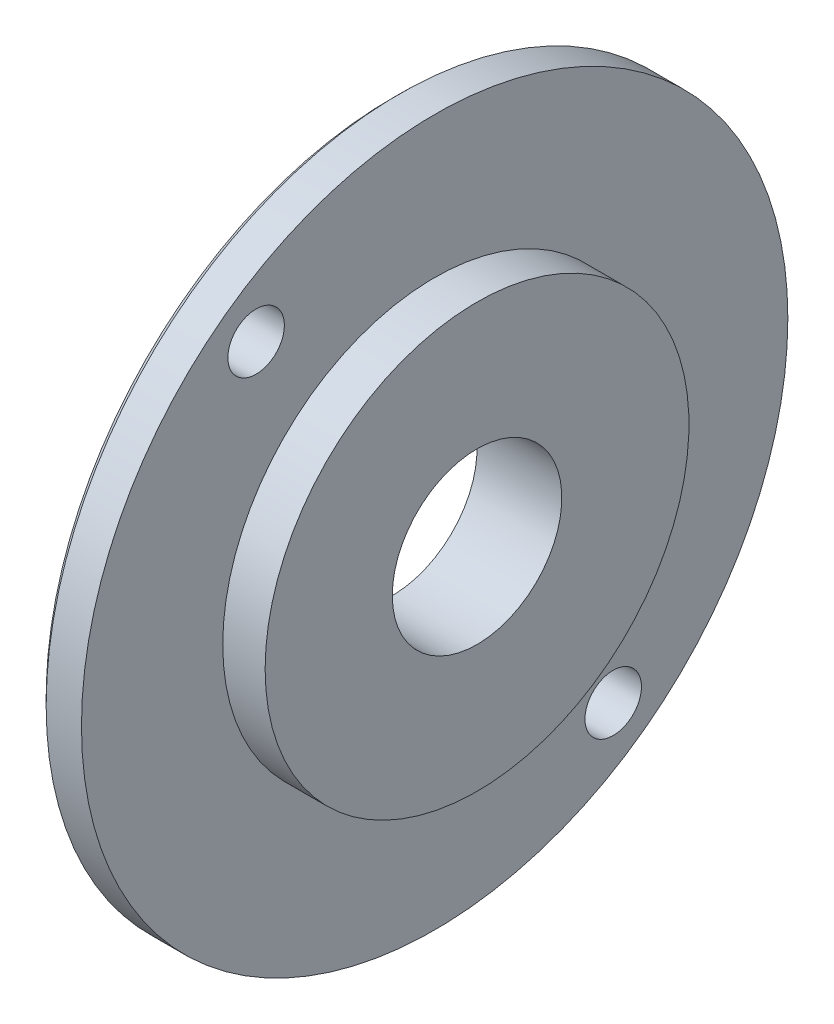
ISO-10303-21;
HEADER;
FILE_DESCRIPTION(('STEP AP214'),'2;1');
FILE_NAME('part.step','',(''),(''),'','','');
FILE_SCHEMA(('AUTOMOTIVE_DESIGN { 1 0 10303 214 1 1 1 1 }'));
ENDSEC;
DATA;
#1=APPLICATION_CONTEXT('core data for automotive mechanical design processes');
#2=APPLICATION_PROTOCOL_DEFINITION('international standard','automotive_design',2000,#1);
#3=PRODUCT_CONTEXT('',#1,'mechanical');
#4=PRODUCT('Part','Part','',(#3));
#5=PRODUCT_RELATED_PRODUCT_CATEGORY('part','',(#4));
#6=PRODUCT_DEFINITION_FORMATION('','',#4);
#7=PRODUCT_DEFINITION_CONTEXT('part definition',#1,'design');
#8=PRODUCT_DEFINITION('design','',#6,#7);
#9=PRODUCT_DEFINITION_SHAPE('','',#8);
#10=(LENGTH_UNIT() NAMED_UNIT(*) SI_UNIT(.MILLI.,.METRE.));
#11=(NAMED_UNIT(*) PLANE_ANGLE_UNIT() SI_UNIT($,.RADIAN.));
#12=(NAMED_UNIT(*) SI_UNIT($,.STERADIAN.) SOLID_ANGLE_UNIT());
#13=UNCERTAINTY_MEASURE_WITH_UNIT(LENGTH_MEASURE(1.E-05),#10,'distance_accuracy_value','');
#14=(GEOMETRIC_REPRESENTATION_CONTEXT(3) GLOBAL_UNCERTAINTY_ASSIGNED_CONTEXT((#13)) GLOBAL_UNIT_ASSIGNED_CONTEXT((#10,
#11,#12)) REPRESENTATION_CONTEXT('',''));
#15=CARTESIAN_POINT('',(0.,0.,0.));
#16=DIRECTION('',(0.,0.,1.));
#17=DIRECTION('',(1.,0.,0.));
#18=AXIS2_PLACEMENT_3D('',#15,#16,#17);
#19=CARTESIAN_POINT('',(3.,0.,0.));
#20=DIRECTION('',(-1.,0.,0.));
#21=DIRECTION('',(0.,0.,1.));
#22=AXIS2_PLACEMENT_3D('',#19,#20,#21);
#23=CYLINDRICAL_SURFACE('',#22,14.9999999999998);
#24=CARTESIAN_POINT('',(3.,0.,0.));
#25=DIRECTION('',(-1.,0.,0.));
#26=DIRECTION('',(0.,0.,1.));
#27=AXIS2_PLACEMENT_3D('',#24,#25,#26);
#28=CIRCLE('',#27,14.9999999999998);
#29=CARTESIAN_POINT('',(3.,0.,14.9999999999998));
#30=VERTEX_POINT('',#29);
#31=EDGE_CURVE('E70',#30,#30,#28,.F.);
#32=ORIENTED_EDGE('',*,*,#31,.F.);
#33=EDGE_LOOP('',(#32));
#34=FACE_BOUND('',#33,.T.);
#35=CARTESIAN_POINT('',(0.,0.,0.));
#36=DIRECTION('',(-1.,0.,0.));
#37=DIRECTION('',(0.,0.,1.));
#38=AXIS2_PLACEMENT_3D('',#35,#36,#37);
#39=CIRCLE('',#38,14.9999999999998);
#40=CARTESIAN_POINT('',(0.,0.,14.9999999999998));
#41=VERTEX_POINT('',#40);
#42=EDGE_CURVE('E62',#41,#41,#39,.T.);
#43=ORIENTED_EDGE('',*,*,#42,.F.);
#44=EDGE_LOOP('',(#43));
#45=FACE_BOUND('',#44,.T.);
#46=ADVANCED_FACE('F14',(#34,#45),#23,.T.);
#47=CARTESIAN_POINT('',(0.,0.,0.));
#48=DIRECTION('',(-1.,0.,0.));
#49=DIRECTION('',(0.,0.,1.));
#50=AXIS2_PLACEMENT_3D('',#47,#48,#49);
#51=CYLINDRICAL_SURFACE('',#50,25.0000000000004);
#52=CARTESIAN_POINT('',(0.,0.,0.));
#53=DIRECTION('',(-1.,0.,0.));
#54=DIRECTION('',(0.,0.,1.));
#55=AXIS2_PLACEMENT_3D('',#52,#53,#54);
#56=CIRCLE('',#55,25.0000000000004);
#57=CARTESIAN_POINT('',(0.,0.,25.0000000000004));
#58=VERTEX_POINT('',#57);
#59=EDGE_CURVE('E65',#58,#58,#56,.F.);
#60=ORIENTED_EDGE('',*,*,#59,.F.);
#61=EDGE_LOOP('',(#60));
#62=FACE_BOUND('',#61,.T.);
#63=CARTESIAN_POINT('',(-2.5,0.,0.));
#64=DIRECTION('',(-1.,0.,0.));
#65=DIRECTION('',(0.,0.809016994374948,0.587785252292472));
#66=AXIS2_PLACEMENT_3D('',#63,#64,#65);
#67=CIRCLE('',#66,25.0000000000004);
#68=CARTESIAN_POINT('',(-2.5,20.225424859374,14.694631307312));
#69=VERTEX_POINT('',#68);
#70=EDGE_CURVE('E59',#69,#69,#67,.F.);
#71=ORIENTED_EDGE('',*,*,#70,.T.);
#72=EDGE_LOOP('',(#71));
#73=FACE_BOUND('',#72,.T.);
#74=ADVANCED_FACE('F79',(#62,#73),#51,.T.);
#75=CARTESIAN_POINT('',(3.,-3.3184761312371,-20.952033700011));
#76=DIRECTION('',(1.,0.,0.));
#77=DIRECTION('',(0.,0.809016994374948,0.587785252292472));
#78=AXIS2_PLACEMENT_3D('',#75,#76,#77);
#79=PLANE('',#78);
#80=CARTESIAN_POINT('',(3.,0.,0.));
#81=DIRECTION('',(-1.,0.,0.));
#82=DIRECTION('',(0.,0.,1.));
#83=AXIS2_PLACEMENT_3D('',#80,#81,#82);
#84=CIRCLE('',#83,5.99999999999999);
#85=CARTESIAN_POINT('',(3.,0.,5.99999999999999));
#86=VERTEX_POINT('',#85);
#87=EDGE_CURVE('E54',#86,#86,#84,.F.);
#88=ORIENTED_EDGE('',*,*,#87,.F.);
#89=EDGE_LOOP('',(#88));
#90=FACE_BOUND('',#89,.T.);
#91=ORIENTED_EDGE('',*,*,#31,.T.);
#92=EDGE_LOOP('',(#91));
#93=FACE_BOUND('',#92,.T.);
#94=ADVANCED_FACE('F75',(#90,#93),#79,.T.);
#95=CARTESIAN_POINT('',(0.,-5.5307935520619,-34.920056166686));
#96=DIRECTION('',(1.,0.,0.));
#97=DIRECTION('',(0.,0.809016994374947,0.587785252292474));
#98=AXIS2_PLACEMENT_3D('',#95,#96,#97);
#99=PLANE('',#98);
#100=CARTESIAN_POINT('',(0.,-17.393865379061,-12.637382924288));
#101=DIRECTION('',(1.,0.,0.));
#102=DIRECTION('',(0.,0.,-1.));
#103=AXIS2_PLACEMENT_3D('',#100,#101,#102);
#104=CIRCLE('',#103,2.00000000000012);
#105=CARTESIAN_POINT('',(0.,-17.393865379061,-14.6373829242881));
#106=VERTEX_POINT('',#105);
#107=EDGE_CURVE('E44',#106,#106,#104,.T.);
#108=ORIENTED_EDGE('',*,*,#107,.F.);
#109=EDGE_LOOP('',(#108));
#110=FACE_BOUND('',#109,.T.);
#111=CARTESIAN_POINT('',(0.,17.393865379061,12.637382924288));
#112=DIRECTION('',(1.,0.,0.));
#113=DIRECTION('',(0.,0.,-1.));
#114=AXIS2_PLACEMENT_3D('',#111,#112,#113);
#115=CIRCLE('',#114,2.00000000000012);
#116=CARTESIAN_POINT('',(0.,17.393865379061,10.6373829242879));
#117=VERTEX_POINT('',#116);
#118=EDGE_CURVE('E49',#117,#117,#115,.T.);
#119=ORIENTED_EDGE('',*,*,#118,.F.);
#120=EDGE_LOOP('',(#119));
#121=FACE_BOUND('',#120,.T.);
#122=ORIENTED_EDGE('',*,*,#42,.T.);
#123=EDGE_LOOP('',(#122));
#124=FACE_BOUND('',#123,.T.);
#125=ORIENTED_EDGE('',*,*,#59,.T.);
#126=EDGE_LOOP('',(#125));
#127=FACE_BOUND('',#126,.T.);
#128=ADVANCED_FACE('F83',(#110,#121,#124,#127),#99,.T.);
#129=CARTESIAN_POINT('',(-2.5,0.,0.));
#130=DIRECTION('',(1.,0.,0.));
#131=DIRECTION('',(0.,0.,-1.));
#132=AXIS2_PLACEMENT_3D('',#129,#130,#131);
#133=CONICAL_SURFACE('',#132,25.0000000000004,0.785398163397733);
#134=ORIENTED_EDGE('',*,*,#70,.F.);
#135=EDGE_LOOP('',(#134));
#136=FACE_BOUND('',#135,.T.);
#137=CARTESIAN_POINT('',(-3.,0.,0.));
#138=DIRECTION('',(1.,0.,0.));
#139=DIRECTION('',(0.,0.,-1.));
#140=AXIS2_PLACEMENT_3D('',#137,#138,#139);
#141=CIRCLE('',#140,24.5000000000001);
#142=CARTESIAN_POINT('',(-3.,0.,-24.5000000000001));
#143=VERTEX_POINT('',#142);
#144=EDGE_CURVE('E39',#143,#143,#141,.F.);
#145=ORIENTED_EDGE('',*,*,#144,.F.);
#146=EDGE_LOOP('',(#145));
#147=FACE_BOUND('',#146,.T.);
#148=ADVANCED_FACE('F86',(#136,#147),#133,.T.);
#149=CARTESIAN_POINT('',(3.,0.,0.));
#150=DIRECTION('',(-1.,0.,0.));
#151=DIRECTION('',(0.,0.,1.));
#152=AXIS2_PLACEMENT_3D('',#149,#150,#151);
#153=CYLINDRICAL_SURFACE('',#152,5.99999999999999);
#154=CARTESIAN_POINT('',(-3.,0.,0.));
#155=DIRECTION('',(-1.,0.,0.));
#156=DIRECTION('',(0.,0.,1.));
#157=AXIS2_PLACEMENT_3D('',#154,#155,#156);
#158=CIRCLE('',#157,5.99999999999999);
#159=CARTESIAN_POINT('',(-3.,0.,5.99999999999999));
#160=VERTEX_POINT('',#159);
#161=EDGE_CURVE('E27',#160,#160,#158,.F.);
#162=ORIENTED_EDGE('',*,*,#161,.F.);
#163=EDGE_LOOP('',(#162));
#164=FACE_BOUND('',#163,.T.);
#165=ORIENTED_EDGE('',*,*,#87,.T.);
#166=EDGE_LOOP('',(#165));
#167=FACE_BOUND('',#166,.T.);
#168=ADVANCED_FACE('F98',(#164,#167),#153,.F.);
#169=CARTESIAN_POINT('',(-3.,17.393865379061,12.637382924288));
#170=DIRECTION('',(1.,0.,0.));
#171=DIRECTION('',(0.,0.,-1.));
#172=AXIS2_PLACEMENT_3D('',#169,#170,#171);
#173=CYLINDRICAL_SURFACE('',#172,2.00000000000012);
#174=CARTESIAN_POINT('',(-3.,17.393865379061,12.637382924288));
#175=DIRECTION('',(1.,0.,0.));
#176=DIRECTION('',(0.,0.,-1.));
#177=AXIS2_PLACEMENT_3D('',#174,#175,#176);
#178=CIRCLE('',#177,2.00000000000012);
#179=CARTESIAN_POINT('',(-3.,17.393865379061,10.6373829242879));
#180=VERTEX_POINT('',#179);
#181=EDGE_CURVE('E22',#180,#180,#178,.T.);
#182=ORIENTED_EDGE('',*,*,#181,.F.);
#183=EDGE_LOOP('',(#182));
#184=FACE_BOUND('',#183,.T.);
#185=ORIENTED_EDGE('',*,*,#118,.T.);
#186=EDGE_LOOP('',(#185));
#187=FACE_BOUND('',#186,.T.);
#188=ADVANCED_FACE('F109',(#184,#187),#173,.F.);
#189=CARTESIAN_POINT('',(-3.,-17.393865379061,-12.637382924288));
#190=DIRECTION('',(1.,0.,0.));
#191=DIRECTION('',(0.,0.,-1.));
#192=AXIS2_PLACEMENT_3D('',#189,#190,#191);
#193=CYLINDRICAL_SURFACE('',#192,2.00000000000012);
#194=CARTESIAN_POINT('',(-3.,-17.393865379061,-12.637382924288));
#195=DIRECTION('',(1.,0.,0.));
#196=DIRECTION('',(0.,0.,-1.));
#197=AXIS2_PLACEMENT_3D('',#194,#195,#196);
#198=CIRCLE('',#197,2.00000000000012);
#199=CARTESIAN_POINT('',(-3.,-17.393865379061,-14.6373829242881));
#200=VERTEX_POINT('',#199);
#201=EDGE_CURVE('E10',#200,#200,#198,.T.);
#202=ORIENTED_EDGE('',*,*,#201,.F.);
#203=EDGE_LOOP('',(#202));
#204=FACE_BOUND('',#203,.T.);
#205=ORIENTED_EDGE('',*,*,#107,.T.);
#206=EDGE_LOOP('',(#205));
#207=FACE_BOUND('',#206,.T.);
#208=ADVANCED_FACE('F103',(#204,#207),#193,.F.);
#209=CARTESIAN_POINT('',(-3.,-34.221655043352,5.4201776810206));
#210=DIRECTION('',(-1.,0.,0.));
#211=DIRECTION('',(0.,0.809016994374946,0.587785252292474));
#212=AXIS2_PLACEMENT_3D('',#209,#210,#211);
#213=PLANE('',#212);
#214=ORIENTED_EDGE('',*,*,#201,.T.);
#215=EDGE_LOOP('',(#214));
#216=FACE_BOUND('',#215,.T.);
#217=ORIENTED_EDGE('',*,*,#181,.T.);
#218=EDGE_LOOP('',(#217));
#219=FACE_BOUND('',#218,.T.);
#220=ORIENTED_EDGE('',*,*,#161,.T.);
#221=EDGE_LOOP('',(#220));
#222=FACE_BOUND('',#221,.T.);
#223=ORIENTED_EDGE('',*,*,#144,.T.);
#224=EDGE_LOOP('',(#223));
#225=FACE_BOUND('',#224,.T.);
#226=ADVANCED_FACE('F16',(#216,#219,#222,#225),#213,.T.);
#227=CLOSED_SHELL('',(#46,#74,#94,#128,#148,#168,#188,#208,#226));
#228=MANIFOLD_SOLID_BREP('B1',#227);
#229=ADVANCED_BREP_SHAPE_REPRESENTATION('',(#18,#228),#14);
#230=SHAPE_DEFINITION_REPRESENTATION(#9,#229);
ENDSEC;
END-ISO-10303-21;
